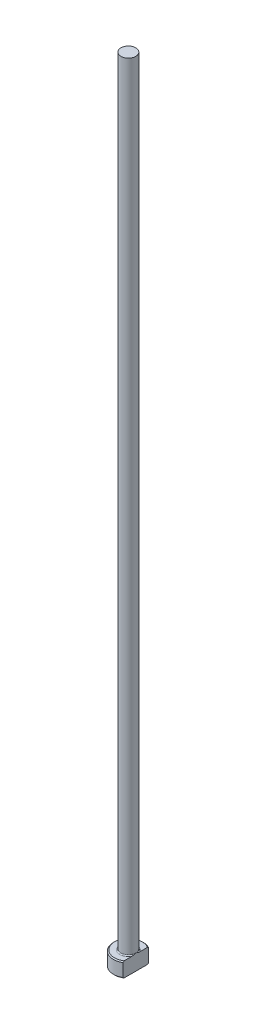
ISO-10303-21;
HEADER;
FILE_DESCRIPTION(('STEP AP214'),'2;1');
FILE_NAME('part.step','',(''),(''),'','','');
FILE_SCHEMA(('AUTOMOTIVE_DESIGN { 1 0 10303 214 1 1 1 1 }'));
ENDSEC;
DATA;
#1=APPLICATION_CONTEXT('core data for automotive mechanical design processes');
#2=APPLICATION_PROTOCOL_DEFINITION('international standard','automotive_design',2000,#1);
#3=PRODUCT_CONTEXT('',#1,'mechanical');
#4=PRODUCT('Part','Part','',(#3));
#5=PRODUCT_RELATED_PRODUCT_CATEGORY('part','',(#4));
#6=PRODUCT_DEFINITION_FORMATION('','',#4);
#7=PRODUCT_DEFINITION_CONTEXT('part definition',#1,'design');
#8=PRODUCT_DEFINITION('design','',#6,#7);
#9=PRODUCT_DEFINITION_SHAPE('','',#8);
#10=(LENGTH_UNIT() NAMED_UNIT(*) SI_UNIT(.MILLI.,.METRE.));
#11=(NAMED_UNIT(*) PLANE_ANGLE_UNIT() SI_UNIT($,.RADIAN.));
#12=(NAMED_UNIT(*) SI_UNIT($,.STERADIAN.) SOLID_ANGLE_UNIT());
#13=UNCERTAINTY_MEASURE_WITH_UNIT(LENGTH_MEASURE(1.E-05),#10,'distance_accuracy_value','');
#14=(GEOMETRIC_REPRESENTATION_CONTEXT(3) GLOBAL_UNCERTAINTY_ASSIGNED_CONTEXT((#13)) GLOBAL_UNIT_ASSIGNED_CONTEXT((#10,
#11,#12)) REPRESENTATION_CONTEXT('',''));
#15=CARTESIAN_POINT('',(0.,0.,0.));
#16=DIRECTION('',(0.,0.,1.));
#17=DIRECTION('',(1.,0.,0.));
#18=AXIS2_PLACEMENT_3D('',#15,#16,#17);
#19=CARTESIAN_POINT('',(0.,0.,0.));
#20=DIRECTION('',(0.,-1.,0.));
#21=DIRECTION('',(0.,0.,-1.));
#22=AXIS2_PLACEMENT_3D('',#19,#20,#21);
#23=PLANE('',#22);
#24=CARTESIAN_POINT('',(0.,0.,0.));
#25=DIRECTION('',(0.,-1.,0.));
#26=DIRECTION('',(0.,0.,-1.));
#27=AXIS2_PLACEMENT_3D('',#24,#25,#26);
#28=CIRCLE('',#27,2.79999999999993);
#29=CARTESIAN_POINT('',(1.49999999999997,0.,2.36431808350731));
#30=VERTEX_POINT('',#29);
#31=CARTESIAN_POINT('',(1.49999999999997,0.,-2.36431808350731));
#32=VERTEX_POINT('',#31);
#33=EDGE_CURVE('E98',#30,#32,#28,.T.);
#34=ORIENTED_EDGE('',*,*,#33,.T.);
#35=DIRECTION('',(0.,0.,1.));
#36=VECTOR('',#35,1.);
#37=CARTESIAN_POINT('',(1.49999999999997,0.,-2.5980762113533));
#38=LINE('',#37,#36);
#39=EDGE_CURVE('E83',#32,#30,#38,.T.);
#40=ORIENTED_EDGE('',*,*,#39,.T.);
#41=EDGE_LOOP('',(#34,#40));
#42=FACE_BOUND('',#41,.T.);
#43=ADVANCED_FACE('F32',(#42),#23,.T.);
#44=CARTESIAN_POINT('',(0.,259.958771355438,0.));
#45=DIRECTION('',(0.,1.,0.));
#46=DIRECTION('',(0.,0.,1.));
#47=AXIS2_PLACEMENT_3D('',#44,#45,#46);
#48=CYLINDRICAL_SURFACE('',#47,2.99999999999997);
#49=CARTESIAN_POINT('',(0.,2.80000000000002,0.));
#50=DIRECTION('',(0.,1.,0.));
#51=DIRECTION('',(0.,0.,1.));
#52=AXIS2_PLACEMENT_3D('',#49,#50,#51);
#53=CIRCLE('',#52,2.99999999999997);
#54=CARTESIAN_POINT('',(1.49999999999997,2.80000000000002,2.5980762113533));
#55=VERTEX_POINT('',#54);
#56=CARTESIAN_POINT('',(1.49999999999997,2.80000000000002,-2.5980762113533));
#57=VERTEX_POINT('',#56);
#58=EDGE_CURVE('E104',#55,#57,#53,.F.);
#59=ORIENTED_EDGE('',*,*,#58,.T.);
#60=DIRECTION('',(0.,-1.,0.));
#61=VECTOR('',#60,1.);
#62=CARTESIAN_POINT('',(1.49999999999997,160.,-2.5980762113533));
#63=LINE('',#62,#61);
#64=CARTESIAN_POINT('',(1.49999999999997,0.200000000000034,-2.5980762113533));
#65=VERTEX_POINT('',#64);
#66=EDGE_CURVE('E183',#57,#65,#63,.T.);
#67=ORIENTED_EDGE('',*,*,#66,.T.);
#68=CARTESIAN_POINT('',(0.,0.200000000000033,0.));
#69=DIRECTION('',(0.,-1.,0.));
#70=DIRECTION('',(0.,0.,-1.));
#71=AXIS2_PLACEMENT_3D('',#68,#69,#70);
#72=CIRCLE('',#71,2.99999999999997);
#73=CARTESIAN_POINT('',(1.49999999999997,0.200000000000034,2.5980762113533));
#74=VERTEX_POINT('',#73);
#75=EDGE_CURVE('E100',#65,#74,#72,.F.);
#76=ORIENTED_EDGE('',*,*,#75,.T.);
#77=DIRECTION('',(0.,-1.,0.));
#78=VECTOR('',#77,1.);
#79=CARTESIAN_POINT('',(1.49999999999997,160.,2.5980762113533));
#80=LINE('',#79,#78);
#81=EDGE_CURVE('E93',#55,#74,#80,.T.);
#82=ORIENTED_EDGE('',*,*,#81,.F.);
#83=EDGE_LOOP('',(#59,#67,#76,#82));
#84=FACE_BOUND('',#83,.T.);
#85=ADVANCED_FACE('F158',(#84),#48,.T.);
#86=CARTESIAN_POINT('',(-2.99999999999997,3.,0.));
#87=DIRECTION('',(0.,1.,0.));
#88=DIRECTION('',(0.,0.,1.));
#89=AXIS2_PLACEMENT_3D('',#86,#87,#88);
#90=PLANE('',#89);
#91=CARTESIAN_POINT('',(0.,3.,0.));
#92=DIRECTION('',(0.,1.,0.));
#93=DIRECTION('',(0.,0.,1.));
#94=AXIS2_PLACEMENT_3D('',#91,#92,#93);
#95=CIRCLE('',#94,2.79999999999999);
#96=CARTESIAN_POINT('',(1.49999999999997,3.,-2.36431808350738));
#97=VERTEX_POINT('',#96);
#98=CARTESIAN_POINT('',(1.49999999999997,3.,2.36431808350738));
#99=VERTEX_POINT('',#98);
#100=EDGE_CURVE('E178',#97,#99,#95,.T.);
#101=ORIENTED_EDGE('',*,*,#100,.T.);
#102=DIRECTION('',(0.,0.,-1.));
#103=VECTOR('',#102,1.);
#104=CARTESIAN_POINT('',(1.49999999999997,3.,0.));
#105=LINE('',#104,#103);
#106=CARTESIAN_POINT('',(1.49999999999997,2.99999999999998,0.799999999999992));
#107=VERTEX_POINT('',#106);
#108=EDGE_CURVE('E57',#99,#107,#105,.T.);
#109=ORIENTED_EDGE('',*,*,#108,.T.);
#110=CARTESIAN_POINT('',(0.,3.,0.));
#111=DIRECTION('',(0.,1.,0.));
#112=DIRECTION('',(0.,0.,1.));
#113=AXIS2_PLACEMENT_3D('',#110,#111,#112);
#114=CIRCLE('',#113,1.69999999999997);
#115=CARTESIAN_POINT('',(1.49999999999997,2.99999999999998,-0.799999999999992));
#116=VERTEX_POINT('',#115);
#117=EDGE_CURVE('E107',#107,#116,#114,.F.);
#118=ORIENTED_EDGE('',*,*,#117,.T.);
#119=EDGE_CURVE('E136',#116,#97,#105,.T.);
#120=ORIENTED_EDGE('',*,*,#119,.T.);
#121=EDGE_LOOP('',(#101,#109,#118,#120));
#122=FACE_BOUND('',#121,.T.);
#123=ADVANCED_FACE('F147',(#122),#90,.T.);
#124=CARTESIAN_POINT('',(0.,3.,0.));
#125=DIRECTION('',(0.,-1.,0.));
#126=DIRECTION('',(0.,0.,-1.));
#127=AXIS2_PLACEMENT_3D('',#124,#125,#126);
#128=CONICAL_SURFACE('',#127,2.79999999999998,0.785398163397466);
#129=ORIENTED_EDGE('',*,*,#58,.F.);
#130=CARTESIAN_POINT('',(1.49999999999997,-0.111741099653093,5.71827621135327));
#131=CARTESIAN_POINT('',(1.49999999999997,0.0136183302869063,5.58866816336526));
#132=CARTESIAN_POINT('',(1.49999999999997,0.138843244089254,5.45892957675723));
#133=CARTESIAN_POINT('',(1.49999999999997,0.388944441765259,5.19911365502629));
#134=CARTESIAN_POINT('',(1.49999999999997,0.513820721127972,5.06903631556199));
#135=CARTESIAN_POINT('',(1.49999999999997,0.763205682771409,4.80840180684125));
#136=CARTESIAN_POINT('',(1.49999999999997,0.887714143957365,4.67784442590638));
#137=CARTESIAN_POINT('',(1.49999999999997,1.13618059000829,4.41620813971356));
#138=CARTESIAN_POINT('',(1.49999999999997,1.26013857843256,4.28512923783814));
#139=CARTESIAN_POINT('',(1.49999999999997,1.50488975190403,4.02490837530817));
#140=CARTESIAN_POINT('',(1.49999999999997,1.6256969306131,3.89577958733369));
#141=CARTESIAN_POINT('',(1.49999999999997,1.86640694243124,3.63668213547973));
#142=CARTESIAN_POINT('',(1.49999999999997,1.98630978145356,3.50671347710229));
#143=CARTESIAN_POINT('',(1.49999999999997,2.22486033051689,3.24567921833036));
#144=CARTESIAN_POINT('',(1.49999999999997,2.34350830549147,3.11461386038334));
#145=CARTESIAN_POINT('',(1.49999999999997,2.57907716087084,2.85094268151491));
#146=CARTESIAN_POINT('',(1.49999999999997,2.69599811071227,2.71833692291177));
#147=CARTESIAN_POINT('',(1.49999999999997,2.88262371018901,2.50255231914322));
#148=CARTESIAN_POINT('',(1.49999999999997,2.95312454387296,2.42006293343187));
#149=CARTESIAN_POINT('',(1.49999999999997,3.0928709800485,2.25401084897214));
#150=CARTESIAN_POINT('',(1.49999999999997,3.16211645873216,2.17044804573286));
#151=CARTESIAN_POINT('',(1.49999999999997,3.29964684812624,2.00105967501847));
#152=CARTESIAN_POINT('',(1.49999999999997,3.36791386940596,1.91521952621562));
#153=CARTESIAN_POINT('',(1.49999999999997,3.50205840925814,1.74171392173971));
#154=CARTESIAN_POINT('',(1.49999999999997,3.56793649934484,1.65404891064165));
#155=CARTESIAN_POINT('',(1.49999999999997,3.69728151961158,1.47490236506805));
#156=CARTESIAN_POINT('',(1.49999999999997,3.76069661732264,1.38338308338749));
#157=CARTESIAN_POINT('',(1.49999999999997,3.8823953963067,1.19675661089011));
#158=CARTESIAN_POINT('',(1.49999999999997,3.94067201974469,1.10164473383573));
#159=CARTESIAN_POINT('',(1.49999999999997,4.04841325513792,0.908008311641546));
#160=CARTESIAN_POINT('',(1.49999999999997,4.0979780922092,0.809540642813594));
#161=CARTESIAN_POINT('',(1.49999999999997,4.18432188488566,0.607192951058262));
#162=CARTESIAN_POINT('',(1.49999999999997,4.22114374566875,0.503332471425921));
#163=CARTESIAN_POINT('',(1.49999999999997,4.26099935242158,0.347577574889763));
#164=CARTESIAN_POINT('',(1.49999999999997,4.27157029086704,0.297609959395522));
#165=CARTESIAN_POINT('',(1.49999999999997,4.28794860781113,0.196885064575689));
#166=CARTESIAN_POINT('',(1.49999999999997,4.29375640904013,0.146127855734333));
#167=CARTESIAN_POINT('',(1.49999999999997,4.30019707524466,0.0444388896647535));
#168=CARTESIAN_POINT('',(1.49999999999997,4.30084594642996,-0.00649183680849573));
#169=CARTESIAN_POINT('',(1.49999999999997,4.29696416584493,-0.108155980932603));
#170=CARTESIAN_POINT('',(1.49999999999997,4.29243308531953,-0.15888938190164));
#171=CARTESIAN_POINT('',(1.49999999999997,4.27856915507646,-0.259234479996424));
#172=CARTESIAN_POINT('',(1.49999999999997,4.26927821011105,-0.30885208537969));
#173=CARTESIAN_POINT('',(1.49999999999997,4.24647108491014,-0.407110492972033));
#174=CARTESIAN_POINT('',(1.49999999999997,4.2329532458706,-0.455750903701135));
#175=CARTESIAN_POINT('',(1.49999999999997,4.20226175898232,-0.552149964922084));
#176=CARTESIAN_POINT('',(1.49999999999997,4.18506801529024,-0.599902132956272));
#177=CARTESIAN_POINT('',(1.49999999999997,4.14771387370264,-0.694205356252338));
#178=CARTESIAN_POINT('',(1.49999999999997,4.1275540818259,-0.740756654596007));
#179=CARTESIAN_POINT('',(1.49999999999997,4.06327696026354,-0.879166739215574));
#180=CARTESIAN_POINT('',(1.49999999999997,4.01551721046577,-0.969329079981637));
#181=CARTESIAN_POINT('',(1.49999999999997,3.91367909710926,-1.1460431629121));
#182=CARTESIAN_POINT('',(1.49999999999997,3.85959300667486,-1.23259031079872));
#183=CARTESIAN_POINT('',(1.49999999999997,3.74697968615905,-1.40321348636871));
#184=CARTESIAN_POINT('',(1.49999999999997,3.68843573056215,-1.48727838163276));
#185=CARTESIAN_POINT('',(1.49999999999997,3.56843845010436,-1.65322187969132));
#186=CARTESIAN_POINT('',(1.49999999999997,3.50698656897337,-1.73510153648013));
#187=CARTESIAN_POINT('',(1.49999999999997,3.38115673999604,-1.89829823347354));
#188=CARTESIAN_POINT('',(1.49999999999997,3.31675092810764,-1.97959369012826));
#189=CARTESIAN_POINT('',(1.49999999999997,3.18634068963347,-2.14090082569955));
#190=CARTESIAN_POINT('',(1.49999999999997,3.12033609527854,-2.22091236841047));
#191=CARTESIAN_POINT('',(1.49999999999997,2.92086431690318,-2.45906508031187));
#192=CARTESIAN_POINT('',(1.49999999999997,2.78562663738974,-2.61572090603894));
#193=CARTESIAN_POINT('',(1.49999999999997,2.53554498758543,-2.90006295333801));
#194=CARTESIAN_POINT('',(1.49999999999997,2.42114543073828,-3.02814382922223));
#195=CARTESIAN_POINT('',(1.49999999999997,2.19093557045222,-3.28303767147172));
#196=CARTESIAN_POINT('',(1.49999999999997,2.07512522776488,-3.40985060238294));
#197=CARTESIAN_POINT('',(1.49999999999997,1.72597067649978,-3.7891384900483));
#198=CARTESIAN_POINT('',(1.49999999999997,1.49111760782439,-4.04022177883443));
#199=CARTESIAN_POINT('',(1.49999999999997,1.02882478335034,-4.52992803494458));
#200=CARTESIAN_POINT('',(1.49999999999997,0.801477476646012,-4.76863870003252));
#201=CARTESIAN_POINT('',(1.49999999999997,0.459548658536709,-5.12558036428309));
#202=CARTESIAN_POINT('',(1.49999999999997,0.345484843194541,-5.2443077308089));
#203=CARTESIAN_POINT('',(1.49999999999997,0.117071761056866,-5.48148573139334));
#204=CARTESIAN_POINT('',(1.49999999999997,0.00272249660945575,-5.59993636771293));
#205=CARTESIAN_POINT('',(1.49999999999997,-0.111741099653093,-5.71827621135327));
#206=B_SPLINE_CURVE_WITH_KNOTS('',3,(#130,#131,#132,#133,#134,#135,#136,#137,#138,#139,#140,
#141,#142,#143,#144,#145,#146,#147,#148,#149,#150,#151,#152,#153,#154,#155,#156,#157,#158,#159,
#160,#161,#162,#163,#164,#165,#166,#167,#168,#169,#170,#171,#172,#173,#174,#175,#176,#177,#178,
#179,#180,#181,#182,#183,#184,#185,#186,#187,#188,#189,#190,#191,#192,#193,#194,#195,#196,#197,
#198,#199,#200,#201,#202,#203,#204,#205),.UNSPECIFIED.,.F.,.F.,(4,2,2,2,2,2,2,2,2,2,2,2,2,2,2,2,
2,2,2,2,2,2,2,2,2,2,2,2,2,2,2,2,2,2,2,2,2,4),(0.,0.540943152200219,1.08189327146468,
1.62312052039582,2.16434426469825,2.69482920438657,3.22531067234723,3.75567781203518,
4.2860235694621,4.61155053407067,4.93710943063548,5.2661094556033,5.59503024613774,
5.92894782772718,6.26331713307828,6.59354403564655,6.92264800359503,7.0756747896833,
7.22868799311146,7.38122626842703,7.53377717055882,7.68500755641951,7.83629736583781,
7.98843643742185,8.14054446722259,8.44618799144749,8.75220879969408,9.05944044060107,
9.36652111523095,9.67764287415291,9.98879742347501,10.6095925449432,11.1247803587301,
11.6399825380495,12.6713544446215,13.6603005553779,14.1542238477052,14.6481430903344),.UNSPECIFIED.);
#207=EDGE_CURVE('E135',#55,#99,#206,.T.);
#208=ORIENTED_EDGE('',*,*,#207,.T.);
#209=ORIENTED_EDGE('',*,*,#100,.F.);
#210=EDGE_CURVE('E127',#97,#57,#206,.T.);
#211=ORIENTED_EDGE('',*,*,#210,.T.);
#212=EDGE_LOOP('',(#129,#208,#209,#211));
#213=FACE_BOUND('',#212,.T.);
#214=ADVANCED_FACE('F143',(#213),#128,.T.);
#215=CARTESIAN_POINT('',(0.,0.200000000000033,0.));
#216=DIRECTION('',(0.,1.,0.));
#217=DIRECTION('',(0.,0.,1.));
#218=AXIS2_PLACEMENT_3D('',#215,#216,#217);
#219=CONICAL_SURFACE('',#218,2.99999999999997,0.785398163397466);
#220=ORIENTED_EDGE('',*,*,#75,.F.);
#221=CARTESIAN_POINT('',(1.49999999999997,3.11174109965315,-5.71827621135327));
#222=CARTESIAN_POINT('',(1.49999999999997,2.98638166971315,-5.58866816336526));
#223=CARTESIAN_POINT('',(1.49999999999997,2.8611567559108,-5.45892957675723));
#224=CARTESIAN_POINT('',(1.49999999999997,2.6110555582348,-5.19911365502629));
#225=CARTESIAN_POINT('',(1.49999999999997,2.48617927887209,-5.06903631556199));
#226=CARTESIAN_POINT('',(1.49999999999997,2.23679431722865,-4.80840180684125));
#227=CARTESIAN_POINT('',(1.49999999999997,2.11228585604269,-4.67784442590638));
#228=CARTESIAN_POINT('',(1.49999999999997,1.86381940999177,-4.41620813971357));
#229=CARTESIAN_POINT('',(1.49999999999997,1.7398614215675,-4.28512923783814));
#230=CARTESIAN_POINT('',(1.49999999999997,1.49511024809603,-4.02490837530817));
#231=CARTESIAN_POINT('',(1.49999999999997,1.37430306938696,-3.89577958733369));
#232=CARTESIAN_POINT('',(1.49999999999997,1.13359305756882,-3.63668213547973));
#233=CARTESIAN_POINT('',(1.49999999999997,1.0136902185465,-3.50671347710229));
#234=CARTESIAN_POINT('',(1.49999999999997,0.775139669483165,-3.24567921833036));
#235=CARTESIAN_POINT('',(1.49999999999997,0.656491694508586,-3.11461386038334));
#236=CARTESIAN_POINT('',(1.49999999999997,0.420922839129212,-2.85094268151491));
#237=CARTESIAN_POINT('',(1.49999999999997,0.304001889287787,-2.71833692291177));
#238=CARTESIAN_POINT('',(1.49999999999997,0.117376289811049,-2.50255231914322));
#239=CARTESIAN_POINT('',(1.49999999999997,0.0468754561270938,-2.42006293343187));
#240=CARTESIAN_POINT('',(1.49999999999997,-0.0928709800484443,-2.25401084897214));
#241=CARTESIAN_POINT('',(1.49999999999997,-0.162116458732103,-2.17044804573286));
#242=CARTESIAN_POINT('',(1.49999999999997,-0.299646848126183,-2.00105967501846));
#243=CARTESIAN_POINT('',(1.49999999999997,-0.367913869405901,-1.91521952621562));
#244=CARTESIAN_POINT('',(1.49999999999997,-0.502058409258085,-1.74171392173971));
#245=CARTESIAN_POINT('',(1.49999999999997,-0.567936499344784,-1.65404891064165));
#246=CARTESIAN_POINT('',(1.49999999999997,-0.697281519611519,-1.47490236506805));
#247=CARTESIAN_POINT('',(1.49999999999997,-0.760696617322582,-1.38338308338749));
#248=CARTESIAN_POINT('',(1.49999999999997,-0.882395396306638,-1.19675661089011));
#249=CARTESIAN_POINT('',(1.49999999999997,-0.940672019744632,-1.10164473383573));
#250=CARTESIAN_POINT('',(1.49999999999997,-1.04841325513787,-0.908008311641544));
#251=CARTESIAN_POINT('',(1.49999999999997,-1.09797809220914,-0.809540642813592));
#252=CARTESIAN_POINT('',(1.49999999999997,-1.1843218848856,-0.60719295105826));
#253=CARTESIAN_POINT('',(1.49999999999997,-1.22114374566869,-0.503332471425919));
#254=CARTESIAN_POINT('',(1.49999999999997,-1.26099935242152,-0.347577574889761));
#255=CARTESIAN_POINT('',(1.49999999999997,-1.27157029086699,-0.29760995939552));
#256=CARTESIAN_POINT('',(1.49999999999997,-1.28794860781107,-0.196885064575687));
#257=CARTESIAN_POINT('',(1.49999999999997,-1.29375640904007,-0.146127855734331));
#258=CARTESIAN_POINT('',(1.49999999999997,-1.30019707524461,-0.0444388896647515));
#259=CARTESIAN_POINT('',(1.49999999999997,-1.3008459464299,0.00649183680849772));
#260=CARTESIAN_POINT('',(1.49999999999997,-1.29696416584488,0.108155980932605));
#261=CARTESIAN_POINT('',(1.49999999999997,-1.29243308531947,0.158889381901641));
#262=CARTESIAN_POINT('',(1.49999999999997,-1.2785691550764,0.259234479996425));
#263=CARTESIAN_POINT('',(1.49999999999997,-1.26927821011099,0.308852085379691));
#264=CARTESIAN_POINT('',(1.49999999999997,-1.24647108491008,0.407110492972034));
#265=CARTESIAN_POINT('',(1.49999999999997,-1.23295324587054,0.455750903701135));
#266=CARTESIAN_POINT('',(1.49999999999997,-1.20226175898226,0.552149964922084));
#267=CARTESIAN_POINT('',(1.49999999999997,-1.18506801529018,0.599902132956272));
#268=CARTESIAN_POINT('',(1.49999999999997,-1.14771387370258,0.694205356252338));
#269=CARTESIAN_POINT('',(1.49999999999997,-1.12755408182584,0.740756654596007));
#270=CARTESIAN_POINT('',(1.49999999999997,-1.06327696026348,0.879166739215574));
#271=CARTESIAN_POINT('',(1.49999999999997,-1.01551721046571,0.969329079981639));
#272=CARTESIAN_POINT('',(1.49999999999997,-0.913679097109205,1.1460431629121));
#273=CARTESIAN_POINT('',(1.49999999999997,-0.8595930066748,1.23259031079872));
#274=CARTESIAN_POINT('',(1.49999999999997,-0.746979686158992,1.40321348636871));
#275=CARTESIAN_POINT('',(1.49999999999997,-0.688435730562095,1.48727838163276));
#276=CARTESIAN_POINT('',(1.49999999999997,-0.568438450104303,1.65322187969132));
#277=CARTESIAN_POINT('',(1.49999999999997,-0.506986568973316,1.73510153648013));
#278=CARTESIAN_POINT('',(1.49999999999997,-0.381156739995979,1.89829823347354));
#279=CARTESIAN_POINT('',(1.49999999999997,-0.316750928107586,1.97959369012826));
#280=CARTESIAN_POINT('',(1.49999999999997,-0.186340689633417,2.14090082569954));
#281=CARTESIAN_POINT('',(1.49999999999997,-0.120336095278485,2.22091236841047));
#282=CARTESIAN_POINT('',(1.49999999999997,0.0791356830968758,2.45906508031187));
#283=CARTESIAN_POINT('',(1.49999999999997,0.214373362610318,2.61572090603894));
#284=CARTESIAN_POINT('',(1.49999999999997,0.46445501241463,2.90006295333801));
#285=CARTESIAN_POINT('',(1.49999999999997,0.578854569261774,3.02814382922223));
#286=CARTESIAN_POINT('',(1.49999999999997,0.809064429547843,3.28303767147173));
#287=CARTESIAN_POINT('',(1.49999999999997,0.924874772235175,3.40985060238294));
#288=CARTESIAN_POINT('',(1.49999999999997,1.27402932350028,3.78913849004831));
#289=CARTESIAN_POINT('',(1.49999999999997,1.50888239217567,4.04022177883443));
#290=CARTESIAN_POINT('',(1.49999999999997,1.97117521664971,4.52992803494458));
#291=CARTESIAN_POINT('',(1.49999999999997,2.19852252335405,4.76863870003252));
#292=CARTESIAN_POINT('',(1.49999999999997,2.54045134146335,5.12558036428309));
#293=CARTESIAN_POINT('',(1.49999999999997,2.65451515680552,5.2443077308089));
#294=CARTESIAN_POINT('',(1.49999999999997,2.88292823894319,5.48148573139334));
#295=CARTESIAN_POINT('',(1.49999999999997,2.9972775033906,5.59993636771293));
#296=CARTESIAN_POINT('',(1.49999999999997,3.11174109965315,5.71827621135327));
#297=B_SPLINE_CURVE_WITH_KNOTS('',3,(#221,#222,#223,#224,#225,#226,#227,#228,#229,#230,#231,
#232,#233,#234,#235,#236,#237,#238,#239,#240,#241,#242,#243,#244,#245,#246,#247,#248,#249,#250,
#251,#252,#253,#254,#255,#256,#257,#258,#259,#260,#261,#262,#263,#264,#265,#266,#267,#268,#269,
#270,#271,#272,#273,#274,#275,#276,#277,#278,#279,#280,#281,#282,#283,#284,#285,#286,#287,#288,
#289,#290,#291,#292,#293,#294,#295,#296),.UNSPECIFIED.,.F.,.F.,(4,2,2,2,2,2,2,2,2,2,2,2,2,2,2,2,
2,2,2,2,2,2,2,2,2,2,2,2,2,2,2,2,2,2,2,2,2,4),(0.,0.540943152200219,1.08189327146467,
1.62312052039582,2.16434426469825,2.69482920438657,3.22531067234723,3.75567781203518,
4.28602356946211,4.61155053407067,4.93710943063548,5.2661094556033,5.59503024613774,
5.92894782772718,6.26331713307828,6.59354403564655,6.92264800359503,7.0756747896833,
7.22868799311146,7.38122626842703,7.53377717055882,7.68500755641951,7.83629736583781,
7.98843643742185,8.14054446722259,8.4461879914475,8.75220879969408,9.05944044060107,
9.36652111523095,9.6776428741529,9.98879742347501,10.6095925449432,11.1247803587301,
11.6399825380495,12.6713544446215,13.6603005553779,14.1542238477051,14.6481430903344),.UNSPECIFIED.);
#298=EDGE_CURVE('E86',#65,#32,#297,.T.);
#299=ORIENTED_EDGE('',*,*,#298,.T.);
#300=ORIENTED_EDGE('',*,*,#33,.F.);
#301=EDGE_CURVE('E89',#30,#74,#297,.T.);
#302=ORIENTED_EDGE('',*,*,#301,.T.);
#303=EDGE_LOOP('',(#220,#299,#300,#302));
#304=FACE_BOUND('',#303,.T.);
#305=ADVANCED_FACE('F97',(#304),#219,.T.);
#306=CARTESIAN_POINT('',(0.,3.19999999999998,0.));
#307=DIRECTION('',(0.,1.,0.));
#308=DIRECTION('',(0.,0.,1.));
#309=AXIS2_PLACEMENT_3D('',#306,#307,#308);
#310=TOROIDAL_SURFACE('',#309,1.69999999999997,0.2);
#311=CARTESIAN_POINT('',(1.49999999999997,3.19999999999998,0.));
#312=CARTESIAN_POINT('',(1.49999999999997,3.20000050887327,7.14686524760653E-11));
#313=CARTESIAN_POINT('',(1.49999999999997,3.20000101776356,-1.21663671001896E-07));
#314=CARTESIAN_POINT('',(1.49999999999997,3.20000199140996,-4.97616231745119E-07));
#315=CARTESIAN_POINT('',(1.49999999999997,3.20000245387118,-7.56516213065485E-07));
#316=CARTESIAN_POINT('',(1.49999999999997,3.20000338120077,-1.37642836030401E-06));
#317=CARTESIAN_POINT('',(1.49999999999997,3.20000384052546,-1.74563475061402E-06));
#318=CARTESIAN_POINT('',(1.49999999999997,3.20000469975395,-2.53565983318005E-06));
#319=CARTESIAN_POINT('',(1.49999999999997,3.20000510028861,-2.95582595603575E-06));
#320=CARTESIAN_POINT('',(1.49999999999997,3.20000646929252,-4.48430443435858E-06));
#321=CARTESIAN_POINT('',(1.49999999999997,3.20000736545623,-5.6586103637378E-06));
#322=CARTESIAN_POINT('',(1.49999999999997,3.20000893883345,-8.06479198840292E-06));
#323=CARTESIAN_POINT('',(1.49999999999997,3.20000962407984,-9.29170513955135E-06));
#324=CARTESIAN_POINT('',(1.49999999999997,3.2000122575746,-1.41623288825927E-05));
#325=CARTESIAN_POINT('',(1.49999999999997,3.20001407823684,-1.78790031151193E-05));
#326=CARTESIAN_POINT('',(1.49999999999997,3.20001699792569,-2.51443065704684E-05));
#327=CARTESIAN_POINT('',(1.49999999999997,3.20001815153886,-2.86715393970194E-05));
#328=CARTESIAN_POINT('',(1.49999999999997,3.20002315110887,-4.39218127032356E-05));
#329=CARTESIAN_POINT('',(1.49999999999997,3.2000270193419,-5.56288388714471E-05));
#330=CARTESIAN_POINT('',(1.49999999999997,3.20003312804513,-7.74058287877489E-05));
#331=CARTESIAN_POINT('',(1.49999999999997,3.20003553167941,-8.7427840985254E-05));
#332=CARTESIAN_POINT('',(1.49999999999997,3.20005483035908,-0.00016122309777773));
#333=CARTESIAN_POINT('',(1.49999999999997,3.2000797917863,-0.000222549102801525));
#334=CARTESIAN_POINT('',(1.49999999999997,3.20017391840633,-0.000462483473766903));
#335=CARTESIAN_POINT('',(1.49999999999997,3.20023706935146,-0.000642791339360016));
#336=CARTESIAN_POINT('',(1.49999999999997,3.20048761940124,-0.00134785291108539));
#337=CARTESIAN_POINT('',(1.49999999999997,3.20068132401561,-0.00187087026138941));
#338=CARTESIAN_POINT('',(1.49999999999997,3.20147357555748,-0.0040200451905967));
#339=CARTESIAN_POINT('',(1.49999999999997,3.20206499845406,-0.00564811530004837));
#340=CARTESIAN_POINT('',(1.49999999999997,3.2089263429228,-0.0245232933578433));
#341=CARTESIAN_POINT('',(1.49999999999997,3.21523683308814,-0.0417598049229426));
#342=CARTESIAN_POINT('',(1.49999999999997,3.22755028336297,-0.0756091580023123));
#343=CARTESIAN_POINT('',(1.49999999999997,3.23355589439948,-0.0922211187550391));
#344=CARTESIAN_POINT('',(1.49999999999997,3.2462010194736,-0.127454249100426));
#345=CARTESIAN_POINT('',(1.49999999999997,3.25283080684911,-0.146078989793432));
#346=CARTESIAN_POINT('',(1.49999999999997,3.26599765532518,-0.183577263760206));
#347=CARTESIAN_POINT('',(1.49999999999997,3.2725330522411,-0.202451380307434));
#348=CARTESIAN_POINT('',(1.49999999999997,3.28834228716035,-0.248982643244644));
#349=CARTESIAN_POINT('',(1.49999999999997,3.29749152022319,-0.276682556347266));
#350=CARTESIAN_POINT('',(1.49999999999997,3.3149093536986,-0.331625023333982));
#351=CARTESIAN_POINT('',(1.49999999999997,3.32319386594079,-0.358862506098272));
#352=CARTESIAN_POINT('',(1.49999999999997,3.34051594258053,-0.419125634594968));
#353=CARTESIAN_POINT('',(1.49999999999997,3.34936607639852,-0.452206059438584));
#354=CARTESIAN_POINT('',(1.49999999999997,3.36549583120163,-0.519023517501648));
#355=CARTESIAN_POINT('',(1.49999999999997,3.37276283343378,-0.552763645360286));
#356=CARTESIAN_POINT('',(1.49999999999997,3.38554755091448,-0.623053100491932));
#357=CARTESIAN_POINT('',(1.49999999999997,3.39090573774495,-0.659632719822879));
#358=CARTESIAN_POINT('',(1.49999999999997,3.39825016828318,-0.733028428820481));
#359=CARTESIAN_POINT('',(1.49999999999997,3.40024734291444,-0.769843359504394));
#360=CARTESIAN_POINT('',(1.49999999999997,3.39970780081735,-0.842856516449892));
#361=CARTESIAN_POINT('',(1.49999999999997,3.39725347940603,-0.87905368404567));
#362=CARTESIAN_POINT('',(1.49999999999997,3.38900085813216,-0.932380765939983));
#363=CARTESIAN_POINT('',(1.49999999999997,3.38553049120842,-0.949868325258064));
#364=CARTESIAN_POINT('',(1.49999999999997,3.37678336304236,-0.98437493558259));
#365=CARTESIAN_POINT('',(1.49999999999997,3.37150943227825,-1.00139467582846));
#366=CARTESIAN_POINT('',(1.49999999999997,3.35869781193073,-1.03479423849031));
#367=CARTESIAN_POINT('',(1.49999999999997,3.3511359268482,-1.05116499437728));
#368=CARTESIAN_POINT('',(1.49999999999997,3.33325333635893,-1.08234828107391));
#369=CARTESIAN_POINT('',(1.49999999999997,3.32294266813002,-1.097166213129));
#370=CARTESIAN_POINT('',(1.49999999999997,3.30512758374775,-1.11714173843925));
#371=CARTESIAN_POINT('',(1.49999999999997,3.29884721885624,-1.1233906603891));
#372=CARTESIAN_POINT('',(1.49999999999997,3.28545950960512,-1.13494695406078));
#373=CARTESIAN_POINT('',(1.49999999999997,3.27835226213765,-1.14025443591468));
#374=CARTESIAN_POINT('',(1.49999999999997,3.26325970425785,-1.14967631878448));
#375=CARTESIAN_POINT('',(1.49999999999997,3.25526534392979,-1.1537764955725));
#376=CARTESIAN_POINT('',(1.49999999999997,3.23863207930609,-1.16034952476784));
#377=CARTESIAN_POINT('',(1.49999999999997,3.22999427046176,-1.16282507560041));
#378=CARTESIAN_POINT('',(1.49999999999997,3.21343922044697,-1.16570267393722));
#379=CARTESIAN_POINT('',(1.49999999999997,3.20555896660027,-1.16631687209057));
#380=CARTESIAN_POINT('',(1.49999999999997,3.18982775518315,-1.16602054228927));
#381=CARTESIAN_POINT('',(1.49999999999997,3.18197679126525,-1.16511036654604));
#382=CARTESIAN_POINT('',(1.49999999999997,3.16747846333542,-1.16204446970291));
#383=CARTESIAN_POINT('',(1.49999999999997,3.16079696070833,-1.16004509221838));
#384=CARTESIAN_POINT('',(1.49999999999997,3.14781700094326,-1.15505972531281));
#385=CARTESIAN_POINT('',(1.49999999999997,3.14151862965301,-1.1520735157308));
#386=CARTESIAN_POINT('',(1.49999999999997,3.12690214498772,-1.14387585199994));
#387=CARTESIAN_POINT('',(1.49999999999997,3.11881436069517,-1.13825400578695));
#388=CARTESIAN_POINT('',(1.49999999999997,3.1036444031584,-1.12578441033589));
#389=CARTESIAN_POINT('',(1.49999999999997,3.09656475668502,-1.11893367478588));
#390=CARTESIAN_POINT('',(1.49999999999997,3.08012297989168,-1.10074342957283));
#391=CARTESIAN_POINT('',(1.49999999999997,3.07136543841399,-1.08886044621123));
#392=CARTESIAN_POINT('',(1.49999999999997,3.05578194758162,-1.06392743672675));
#393=CARTESIAN_POINT('',(1.49999999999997,3.0489571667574,-1.05087671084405));
#394=CARTESIAN_POINT('',(1.49999999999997,3.03273856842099,-1.0147230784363));
#395=CARTESIAN_POINT('',(1.49999999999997,3.02486230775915,-0.990945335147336));
#396=CARTESIAN_POINT('',(1.49999999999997,3.01257693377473,-0.942321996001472));
#397=CARTESIAN_POINT('',(1.49999999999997,3.00820590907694,-0.917467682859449));
#398=CARTESIAN_POINT('',(1.49999999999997,3.00229956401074,-0.867912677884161));
#399=CARTESIAN_POINT('',(1.49999999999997,3.0007128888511,-0.843217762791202));
#400=CARTESIAN_POINT('',(1.49999999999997,2.9996723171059,-0.793746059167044));
#401=CARTESIAN_POINT('',(1.49999999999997,3.0002230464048,-0.768969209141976));
#402=CARTESIAN_POINT('',(1.49999999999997,3.00433101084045,-0.696994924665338));
#403=CARTESIAN_POINT('',(1.49999999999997,3.01016976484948,-0.649931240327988));
#404=CARTESIAN_POINT('',(1.49999999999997,3.02567776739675,-0.559166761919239));
#405=CARTESIAN_POINT('',(1.49999999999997,3.03511950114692,-0.515423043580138));
#406=CARTESIAN_POINT('',(1.49999999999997,3.05693059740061,-0.427590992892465));
#407=CARTESIAN_POINT('',(1.49999999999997,3.0693635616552,-0.383518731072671));
#408=CARTESIAN_POINT('',(1.49999999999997,3.0917495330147,-0.310161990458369));
#409=CARTESIAN_POINT('',(1.49999999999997,3.1011984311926,-0.280718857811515));
#410=CARTESIAN_POINT('',(1.49999999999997,3.12060442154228,-0.22234098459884));
#411=CARTESIAN_POINT('',(1.49999999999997,3.13055519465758,-0.193404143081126));
#412=CARTESIAN_POINT('',(1.49999999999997,3.14973721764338,-0.1387568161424));
#413=CARTESIAN_POINT('',(1.49999999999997,3.15893123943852,-0.113033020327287));
#414=CARTESIAN_POINT('',(1.49999999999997,3.17788037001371,-0.0606351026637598));
#415=CARTESIAN_POINT('',(1.49999999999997,3.18764328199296,-0.0339636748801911));
#416=CARTESIAN_POINT('',(1.49999999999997,3.19793548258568,-0.00564657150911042));
#417=CARTESIAN_POINT('',(1.49999999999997,3.19852751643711,-0.00401699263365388));
#418=CARTESIAN_POINT('',(1.49999999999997,3.1993199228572,-0.00186745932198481));
#419=CARTESIAN_POINT('',(1.49999999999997,3.1995131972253,-0.00134559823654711));
#420=CARTESIAN_POINT('',(1.49999999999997,3.19976322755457,-0.000641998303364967));
#421=CARTESIAN_POINT('',(1.49999999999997,3.19982627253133,-0.000461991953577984));
#422=CARTESIAN_POINT('',(1.49999999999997,3.19992025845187,-0.000222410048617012));
#423=CARTESIAN_POINT('',(1.49999999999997,3.19994519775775,-0.000161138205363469));
#424=CARTESIAN_POINT('',(1.49999999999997,3.1999644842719,-8.74039265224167E-05));
#425=CARTESIAN_POINT('',(1.49999999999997,3.19996688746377,-7.73857554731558E-05));
#426=CARTESIAN_POINT('',(1.49999999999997,3.19997299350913,-5.56173270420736E-05));
#427=CARTESIAN_POINT('',(1.49999999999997,3.19997685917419,-4.39149185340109E-05));
#428=CARTESIAN_POINT('',(1.49999999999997,3.19998185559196,-2.86698156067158E-05));
#429=CARTESIAN_POINT('',(1.49999999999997,3.19998300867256,-2.51431574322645E-05));
#430=CARTESIAN_POINT('',(1.49999999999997,3.19998592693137,-1.78789551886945E-05));
#431=CARTESIAN_POINT('',(1.49999999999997,3.19998774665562,-1.41627846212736E-05));
#432=CARTESIAN_POINT('',(1.49999999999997,3.1999903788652,-9.29264485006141E-06));
#433=CARTESIAN_POINT('',(1.49999999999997,3.19999106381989,-8.06577596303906E-06));
#434=CARTESIAN_POINT('',(1.49999999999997,3.19999263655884,-5.65962636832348E-06));
#435=CARTESIAN_POINT('',(1.49999999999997,3.19999353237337,-4.48530463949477E-06));
#436=CARTESIAN_POINT('',(1.49999999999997,3.19999490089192,-2.95673739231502E-06));
#437=CARTESIAN_POINT('',(1.49999999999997,3.19999530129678,-2.53653206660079E-06));
#438=CARTESIAN_POINT('',(1.49999999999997,3.19999616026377,-1.74640524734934E-06));
#439=CARTESIAN_POINT('',(1.49999999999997,3.19999661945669,-1.37713597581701E-06));
#440=CARTESIAN_POINT('',(1.49999999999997,3.19999754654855,-7.57072329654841E-07));
#441=CARTESIAN_POINT('',(1.49999999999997,3.1999980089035,-4.98087382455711E-07));
#442=CARTESIAN_POINT('',(1.49999999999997,3.19999898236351,-1.21927247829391E-07));
#443=CARTESIAN_POINT('',(1.49999999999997,3.19999949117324,-7.14621145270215E-11));
#444=CARTESIAN_POINT('',(1.49999999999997,3.19999999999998,0.));
#445=B_SPLINE_CURVE_WITH_KNOTS('',3,(#311,#312,#313,#314,#315,#316,#317,#318,#319,#320,#321,
#322,#323,#324,#325,#326,#327,#328,#329,#330,#331,#332,#333,#334,#335,#336,#337,#338,#339,#340,
#341,#342,#343,#344,#345,#346,#347,#348,#349,#350,#351,#352,#353,#354,#355,#356,#357,#358,#359,
#360,#361,#362,#363,#364,#365,#366,#367,#368,#369,#370,#371,#372,#373,#374,#375,#376,#377,#378,
#379,#380,#381,#382,#383,#384,#385,#386,#387,#388,#389,#390,#391,#392,#393,#394,#395,#396,#397,
#398,#399,#400,#401,#402,#403,#404,#405,#406,#407,#408,#409,#410,#411,#412,#413,#414,#415,#416,
#417,#418,#419,#420,#421,#422,#423,#424,#425,#426,#427,#428,#429,#430,#431,#432,#433,#434,#435,
#436,#437,#438,#439,#440,#441,#442,#443,#444),.UNSPECIFIED.,.T.,.F.,(4,2,2,2,2,2,2,2,2,2,2,2,2,
2,2,2,2,2,2,2,2,2,2,2,2,2,2,2,2,2,2,2,2,2,2,2,2,2,2,2,2,2,2,2,2,2,2,2,2,2,2,2,2,2,2,2,2,2,2,2,2,
2,2,2,2,2,4),(0.,1.5268750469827E-06,3.1095939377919E-06,4.8697676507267E-06,
6.6094009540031E-06,1.1020252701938E-05,1.52327800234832E-05,2.76140373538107E-05,
3.87351647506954E-05,7.57188333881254E-05,0.000106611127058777,0.000304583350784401,
0.000878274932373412,0.00255078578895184,0.00774802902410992,0.0628090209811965,
0.115802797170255,0.175110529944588,0.235030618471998,0.322539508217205,0.407938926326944,
0.510638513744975,0.614128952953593,0.724918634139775,0.835347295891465,0.943752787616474,
0.997165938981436,1.05049564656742,1.10441029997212,1.1581307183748,1.18463966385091,
1.21114550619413,1.23795217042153,1.26471419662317,1.28828324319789,1.31184684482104,
1.33268332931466,1.35352446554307,1.38290826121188,1.41236445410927,1.45639976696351,
1.5004616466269,1.5751878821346,1.65071550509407,1.72483484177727,1.79911468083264,
1.94105061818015,2.07520625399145,2.21251544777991,2.30527614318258,2.3970705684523,
2.47902409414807,2.56422207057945,2.56942417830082,2.57109299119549,2.57166572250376,
2.57186352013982,2.57189440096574,2.57193136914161,2.5719424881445,2.5719548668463,
2.57195907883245,2.5719634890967,2.571965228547,2.57196698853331,2.5719685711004,
2.57197009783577),.UNSPECIFIED.);
#446=CARTESIAN_POINT('',(1.49999999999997,3.19999999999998,0.));
#447=VERTEX_POINT('',#446);
#448=EDGE_CURVE('E11',#116,#447,#445,.T.);
#449=ORIENTED_EDGE('',*,*,#448,.F.);
#450=ORIENTED_EDGE('',*,*,#117,.F.);
#451=CARTESIAN_POINT('',(1.49999999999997,3.19999999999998,0.));
#452=CARTESIAN_POINT('',(1.49999999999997,3.19999949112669,-7.14686931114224E-11));
#453=CARTESIAN_POINT('',(1.49999999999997,3.1999989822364,1.21663670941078E-07));
#454=CARTESIAN_POINT('',(1.49999999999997,3.19999800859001,4.97616231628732E-07));
#455=CARTESIAN_POINT('',(1.49999999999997,3.19999754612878,7.56516212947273E-07));
#456=CARTESIAN_POINT('',(1.49999999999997,3.19999661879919,1.37642836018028E-06));
#457=CARTESIAN_POINT('',(1.49999999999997,3.1999961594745,1.74563475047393E-06));
#458=CARTESIAN_POINT('',(1.49999999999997,3.19999530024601,2.53565983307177E-06));
#459=CARTESIAN_POINT('',(1.49999999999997,3.19999489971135,2.95582595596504E-06));
#460=CARTESIAN_POINT('',(1.49999999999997,3.19999353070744,4.48430443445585E-06));
#461=CARTESIAN_POINT('',(1.49999999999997,3.19999263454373,5.65861036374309E-06));
#462=CARTESIAN_POINT('',(1.49999999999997,3.19999106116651,8.06479198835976E-06));
#463=CARTESIAN_POINT('',(1.49999999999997,3.19999037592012,9.29170513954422E-06));
#464=CARTESIAN_POINT('',(1.49999999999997,3.19998774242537,1.41623288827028E-05));
#465=CARTESIAN_POINT('',(1.49999999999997,3.19998592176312,1.78790031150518E-05));
#466=CARTESIAN_POINT('',(1.49999999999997,3.19998300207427,2.51443065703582E-05));
#467=CARTESIAN_POINT('',(1.49999999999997,3.1999818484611,2.86715393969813E-05));
#468=CARTESIAN_POINT('',(1.49999999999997,3.19997684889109,4.39218127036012E-05));
#469=CARTESIAN_POINT('',(1.49999999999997,3.19997298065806,5.56288388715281E-05));
#470=CARTESIAN_POINT('',(1.49999999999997,3.19996687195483,7.7405828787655E-05));
#471=CARTESIAN_POINT('',(1.49999999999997,3.19996446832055,8.74278409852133E-05));
#472=CARTESIAN_POINT('',(1.49999999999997,3.19994516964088,0.000161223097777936));
#473=CARTESIAN_POINT('',(1.49999999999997,3.19992020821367,0.00022254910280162));
#474=CARTESIAN_POINT('',(1.49999999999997,3.19982608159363,0.000462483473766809));
#475=CARTESIAN_POINT('',(1.49999999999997,3.1997629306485,0.000642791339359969));
#476=CARTESIAN_POINT('',(1.49999999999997,3.19951238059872,0.00134785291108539));
#477=CARTESIAN_POINT('',(1.49999999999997,3.19931867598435,0.00187087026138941));
#478=CARTESIAN_POINT('',(1.49999999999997,3.19852642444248,0.0040200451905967));
#479=CARTESIAN_POINT('',(1.49999999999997,3.19793500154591,0.00564811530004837));
#480=CARTESIAN_POINT('',(1.49999999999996,3.19107365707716,0.0245232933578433));
#481=CARTESIAN_POINT('',(1.49999999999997,3.18476316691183,0.0417598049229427));
#482=CARTESIAN_POINT('',(1.49999999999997,3.17244971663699,0.0756091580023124));
#483=CARTESIAN_POINT('',(1.49999999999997,3.16644410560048,0.0922211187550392));
#484=CARTESIAN_POINT('',(1.49999999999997,3.15379898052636,0.127454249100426));
#485=CARTESIAN_POINT('',(1.49999999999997,3.14716919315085,0.146078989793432));
#486=CARTESIAN_POINT('',(1.49999999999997,3.13400234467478,0.183577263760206));
#487=CARTESIAN_POINT('',(1.49999999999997,3.12746694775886,0.202451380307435));
#488=CARTESIAN_POINT('',(1.49999999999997,3.11165771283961,0.248982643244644));
#489=CARTESIAN_POINT('',(1.49999999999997,3.10250847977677,0.276682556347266));
#490=CARTESIAN_POINT('',(1.49999999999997,3.08509064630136,0.331625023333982));
#491=CARTESIAN_POINT('',(1.49999999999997,3.07680613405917,0.358862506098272));
#492=CARTESIAN_POINT('',(1.49999999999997,3.05948405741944,0.419125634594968));
#493=CARTESIAN_POINT('',(1.49999999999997,3.05063392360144,0.452206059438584));
#494=CARTESIAN_POINT('',(1.49999999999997,3.03450416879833,0.519023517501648));
#495=CARTESIAN_POINT('',(1.49999999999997,3.02723716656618,0.552763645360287));
#496=CARTESIAN_POINT('',(1.49999999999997,3.01445244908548,0.623053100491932));
#497=CARTESIAN_POINT('',(1.49999999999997,3.00909426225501,0.659632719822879));
#498=CARTESIAN_POINT('',(1.49999999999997,3.00174983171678,0.733028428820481));
#499=CARTESIAN_POINT('',(1.49999999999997,2.99975265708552,0.769843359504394));
#500=CARTESIAN_POINT('',(1.49999999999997,3.00029219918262,0.842856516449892));
#501=CARTESIAN_POINT('',(1.49999999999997,3.00274652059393,0.87905368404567));
#502=CARTESIAN_POINT('',(1.49999999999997,3.0109991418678,0.932380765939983));
#503=CARTESIAN_POINT('',(1.49999999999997,3.01446950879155,0.949868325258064));
#504=CARTESIAN_POINT('',(1.49999999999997,3.02321663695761,0.98437493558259));
#505=CARTESIAN_POINT('',(1.49999999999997,3.02849056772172,1.00139467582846));
#506=CARTESIAN_POINT('',(1.49999999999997,3.04130218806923,1.03479423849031));
#507=CARTESIAN_POINT('',(1.49999999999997,3.04886407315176,1.05116499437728));
#508=CARTESIAN_POINT('',(1.49999999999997,3.06674666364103,1.08234828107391));
#509=CARTESIAN_POINT('',(1.49999999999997,3.07705733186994,1.097166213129));
#510=CARTESIAN_POINT('',(1.49999999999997,3.09487241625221,1.11714173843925));
#511=CARTESIAN_POINT('',(1.49999999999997,3.10115278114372,1.1233906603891));
#512=CARTESIAN_POINT('',(1.49999999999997,3.11454049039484,1.13494695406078));
#513=CARTESIAN_POINT('',(1.49999999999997,3.12164773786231,1.14025443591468));
#514=CARTESIAN_POINT('',(1.49999999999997,3.13674029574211,1.14967631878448));
#515=CARTESIAN_POINT('',(1.49999999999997,3.14473465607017,1.1537764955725));
#516=CARTESIAN_POINT('',(1.49999999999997,3.16136792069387,1.16034952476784));
#517=CARTESIAN_POINT('',(1.49999999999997,3.1700057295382,1.16282507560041));
#518=CARTESIAN_POINT('',(1.49999999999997,3.18656077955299,1.16570267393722));
#519=CARTESIAN_POINT('',(1.49999999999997,3.19444103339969,1.16631687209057));
#520=CARTESIAN_POINT('',(1.49999999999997,3.21017224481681,1.16602054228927));
#521=CARTESIAN_POINT('',(1.49999999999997,3.21802320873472,1.16511036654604));
#522=CARTESIAN_POINT('',(1.49999999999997,3.23252153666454,1.16204446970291));
#523=CARTESIAN_POINT('',(1.49999999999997,3.23920303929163,1.16004509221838));
#524=CARTESIAN_POINT('',(1.49999999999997,3.2521829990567,1.15505972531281));
#525=CARTESIAN_POINT('',(1.49999999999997,3.25848137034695,1.1520735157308));
#526=CARTESIAN_POINT('',(1.49999999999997,3.27309785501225,1.14387585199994));
#527=CARTESIAN_POINT('',(1.49999999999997,3.28118563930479,1.13825400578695));
#528=CARTESIAN_POINT('',(1.49999999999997,3.29635559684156,1.12578441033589));
#529=CARTESIAN_POINT('',(1.49999999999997,3.30343524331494,1.11893367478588));
#530=CARTESIAN_POINT('',(1.49999999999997,3.31987702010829,1.10074342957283));
#531=CARTESIAN_POINT('',(1.49999999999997,3.32863456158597,1.08886044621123));
#532=CARTESIAN_POINT('',(1.49999999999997,3.34421805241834,1.06392743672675));
#533=CARTESIAN_POINT('',(1.49999999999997,3.35104283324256,1.05087671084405));
#534=CARTESIAN_POINT('',(1.49999999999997,3.36726143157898,1.0147230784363));
#535=CARTESIAN_POINT('',(1.49999999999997,3.37513769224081,0.990945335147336));
#536=CARTESIAN_POINT('',(1.49999999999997,3.38742306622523,0.942321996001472));
#537=CARTESIAN_POINT('',(1.49999999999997,3.39179409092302,0.917467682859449));
#538=CARTESIAN_POINT('',(1.49999999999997,3.39770043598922,0.867912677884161));
#539=CARTESIAN_POINT('',(1.49999999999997,3.39928711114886,0.843217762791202));
#540=CARTESIAN_POINT('',(1.49999999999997,3.40032768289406,0.793746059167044));
#541=CARTESIAN_POINT('',(1.49999999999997,3.39977695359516,0.768969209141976));
#542=CARTESIAN_POINT('',(1.49999999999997,3.39566898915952,0.696994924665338));
#543=CARTESIAN_POINT('',(1.49999999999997,3.38983023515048,0.649931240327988));
#544=CARTESIAN_POINT('',(1.49999999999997,3.37432223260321,0.559166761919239));
#545=CARTESIAN_POINT('',(1.49999999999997,3.36488049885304,0.515423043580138));
#546=CARTESIAN_POINT('',(1.49999999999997,3.34306940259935,0.427590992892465));
#547=CARTESIAN_POINT('',(1.49999999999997,3.33063643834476,0.383518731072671));
#548=CARTESIAN_POINT('',(1.49999999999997,3.30825046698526,0.310161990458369));
#549=CARTESIAN_POINT('',(1.49999999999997,3.29880156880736,0.280718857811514));
#550=CARTESIAN_POINT('',(1.49999999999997,3.27939557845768,0.22234098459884));
#551=CARTESIAN_POINT('',(1.49999999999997,3.26944480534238,0.193404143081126));
#552=CARTESIAN_POINT('',(1.49999999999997,3.25026278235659,0.1387568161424));
#553=CARTESIAN_POINT('',(1.49999999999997,3.24106876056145,0.113033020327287));
#554=CARTESIAN_POINT('',(1.49999999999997,3.22211962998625,0.0606351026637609));
#555=CARTESIAN_POINT('',(1.49999999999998,3.21235671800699,0.0339636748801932));
#556=CARTESIAN_POINT('',(1.49999999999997,3.20206451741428,0.0056465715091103));
#557=CARTESIAN_POINT('',(1.49999999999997,3.20147248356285,0.00401699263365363));
#558=CARTESIAN_POINT('',(1.49999999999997,3.20068007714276,0.00186745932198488));
#559=CARTESIAN_POINT('',(1.49999999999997,3.20048680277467,0.0013455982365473));
#560=CARTESIAN_POINT('',(1.49999999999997,3.20023677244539,0.000641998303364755));
#561=CARTESIAN_POINT('',(1.49999999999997,3.20017372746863,0.000461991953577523));
#562=CARTESIAN_POINT('',(1.49999999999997,3.2000797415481,0.000222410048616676));
#563=CARTESIAN_POINT('',(1.49999999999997,3.20005480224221,0.000161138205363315));
#564=CARTESIAN_POINT('',(1.49999999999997,3.20003551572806,8.74039265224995E-05));
#565=CARTESIAN_POINT('',(1.49999999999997,3.20003311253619,7.73857554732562E-05));
#566=CARTESIAN_POINT('',(1.49999999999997,3.20002700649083,5.56173270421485E-05));
#567=CARTESIAN_POINT('',(1.49999999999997,3.20002314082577,4.39149185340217E-05));
#568=CARTESIAN_POINT('',(1.49999999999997,3.200018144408,2.866981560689E-05));
#569=CARTESIAN_POINT('',(1.49999999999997,3.2000169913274,2.51431574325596E-05));
#570=CARTESIAN_POINT('',(1.49999999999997,3.20001407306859,1.78789551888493E-05));
#571=CARTESIAN_POINT('',(1.49999999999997,3.20001225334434,1.41627846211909E-05));
#572=CARTESIAN_POINT('',(1.49999999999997,3.20000962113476,9.29264484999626E-06));
#573=CARTESIAN_POINT('',(1.49999999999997,3.20000893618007,8.06577596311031E-06));
#574=CARTESIAN_POINT('',(1.49999999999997,3.20000736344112,5.65962636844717E-06));
#575=CARTESIAN_POINT('',(1.49999999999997,3.20000646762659,4.48530463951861E-06));
#576=CARTESIAN_POINT('',(1.49999999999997,3.20000509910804,2.95673739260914E-06));
#577=CARTESIAN_POINT('',(1.49999999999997,3.20000469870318,2.53653206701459E-06));
#578=CARTESIAN_POINT('',(1.49999999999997,3.2000038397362,1.74640524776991E-06));
#579=CARTESIAN_POINT('',(1.49999999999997,3.20000338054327,1.37713597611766E-06));
#580=CARTESIAN_POINT('',(1.49999999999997,3.20000245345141,7.57072329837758E-07));
#581=CARTESIAN_POINT('',(1.49999999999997,3.20000199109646,4.98087382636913E-07));
#582=CARTESIAN_POINT('',(1.49999999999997,3.20000101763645,1.21927247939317E-07));
#583=CARTESIAN_POINT('',(1.49999999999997,3.20000050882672,7.14621551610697E-11));
#584=CARTESIAN_POINT('',(1.49999999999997,3.19999999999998,0.));
#585=B_SPLINE_CURVE_WITH_KNOTS('',3,(#451,#452,#453,#454,#455,#456,#457,#458,#459,#460,#461,
#462,#463,#464,#465,#466,#467,#468,#469,#470,#471,#472,#473,#474,#475,#476,#477,#478,#479,#480,
#481,#482,#483,#484,#485,#486,#487,#488,#489,#490,#491,#492,#493,#494,#495,#496,#497,#498,#499,
#500,#501,#502,#503,#504,#505,#506,#507,#508,#509,#510,#511,#512,#513,#514,#515,#516,#517,#518,
#519,#520,#521,#522,#523,#524,#525,#526,#527,#528,#529,#530,#531,#532,#533,#534,#535,#536,#537,
#538,#539,#540,#541,#542,#543,#544,#545,#546,#547,#548,#549,#550,#551,#552,#553,#554,#555,#556,
#557,#558,#559,#560,#561,#562,#563,#564,#565,#566,#567,#568,#569,#570,#571,#572,#573,#574,#575,
#576,#577,#578,#579,#580,#581,#582,#583,#584),.UNSPECIFIED.,.T.,.F.,(4,2,2,2,2,2,2,2,2,2,2,2,2,
2,2,2,2,2,2,2,2,2,2,2,2,2,2,2,2,2,2,2,2,2,2,2,2,2,2,2,2,2,2,2,2,2,2,2,2,2,2,2,2,2,2,2,2,2,2,2,2,
2,2,2,2,2,4),(0.,1.52687504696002E-06,3.1095939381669E-06,4.86976765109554E-06,
6.60940095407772E-06,1.10202527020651E-05,1.52327800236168E-05,2.76140373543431E-05,
3.87351647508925E-05,7.5718833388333E-05,0.000106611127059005,0.00030458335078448,
0.00087827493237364,0.00255078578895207,0.00774802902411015,0.0628090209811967,
0.115802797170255,0.175110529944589,0.235030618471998,0.322539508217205,0.407938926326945,
0.510638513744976,0.614128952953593,0.724918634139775,0.835347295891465,0.943752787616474,
0.997165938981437,1.05049564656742,1.10441029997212,1.1581307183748,1.18463966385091,
1.21114550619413,1.23795217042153,1.26471419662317,1.28828324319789,1.31184684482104,
1.33268332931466,1.35352446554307,1.38290826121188,1.41236445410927,1.45639976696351,
1.5004616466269,1.5751878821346,1.65071550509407,1.72483484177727,1.79911468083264,
1.94105061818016,2.07520625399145,2.21251544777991,2.30527614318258,2.3970705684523,
2.47902409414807,2.56422207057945,2.56942417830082,2.5710929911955,2.57166572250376,
2.57186352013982,2.57189440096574,2.57193136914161,2.5719424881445,2.5719548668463,
2.57195907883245,2.5719634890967,2.571965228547,2.5719669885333,2.5719685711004,
2.57197009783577),.UNSPECIFIED.);
#586=EDGE_CURVE('E46',#447,#107,#585,.T.);
#587=ORIENTED_EDGE('',*,*,#586,.F.);
#588=CARTESIAN_POINT('',(0.,3.19999999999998,0.));
#589=DIRECTION('',(0.,1.,0.));
#590=DIRECTION('',(0.,0.,1.));
#591=AXIS2_PLACEMENT_3D('',#588,#589,#590);
#592=CIRCLE('',#591,1.49999999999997);
#593=EDGE_CURVE('E103',#447,#447,#592,.T.);
#594=ORIENTED_EDGE('',*,*,#593,.F.);
#595=EDGE_LOOP('',(#449,#450,#587,#594));
#596=FACE_BOUND('',#595,.T.);
#597=ADVANCED_FACE('F34',(#596),#310,.F.);
#598=CARTESIAN_POINT('',(0.,259.958771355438,0.));
#599=DIRECTION('',(0.,1.,0.));
#600=DIRECTION('',(0.,0.,1.));
#601=AXIS2_PLACEMENT_3D('',#598,#599,#600);
#602=CYLINDRICAL_SURFACE('',#601,1.49999999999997);
#603=ORIENTED_EDGE('',*,*,#593,.T.);
#604=EDGE_LOOP('',(#603));
#605=FACE_BOUND('',#604,.T.);
#606=CARTESIAN_POINT('',(0.,160.,0.));
#607=DIRECTION('',(0.,1.,0.));
#608=DIRECTION('',(0.,0.,1.));
#609=AXIS2_PLACEMENT_3D('',#606,#607,#608);
#610=CIRCLE('',#609,1.49999999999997);
#611=CARTESIAN_POINT('',(0.,160.,1.49999999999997));
#612=VERTEX_POINT('',#611);
#613=EDGE_CURVE('E101',#612,#612,#610,.T.);
#614=ORIENTED_EDGE('',*,*,#613,.F.);
#615=EDGE_LOOP('',(#614));
#616=FACE_BOUND('',#615,.T.);
#617=ADVANCED_FACE('F155',(#605,#616),#602,.T.);
#618=CARTESIAN_POINT('',(-1.49999999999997,160.,0.));
#619=DIRECTION('',(0.,1.,0.));
#620=DIRECTION('',(0.,0.,1.));
#621=AXIS2_PLACEMENT_3D('',#618,#619,#620);
#622=PLANE('',#621);
#623=ORIENTED_EDGE('',*,*,#613,.T.);
#624=EDGE_LOOP('',(#623));
#625=FACE_BOUND('',#624,.T.);
#626=ADVANCED_FACE('F121',(#625),#622,.T.);
#627=CARTESIAN_POINT('',(1.49999999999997,160.,-2.5980762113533));
#628=DIRECTION('',(1.,0.,0.));
#629=DIRECTION('',(0.,0.,-1.));
#630=AXIS2_PLACEMENT_3D('',#627,#628,#629);
#631=PLANE('',#630);
#632=ORIENTED_EDGE('',*,*,#66,.F.);
#633=ORIENTED_EDGE('',*,*,#210,.F.);
#634=ORIENTED_EDGE('',*,*,#119,.F.);
#635=ORIENTED_EDGE('',*,*,#448,.T.);
#636=ORIENTED_EDGE('',*,*,#586,.T.);
#637=ORIENTED_EDGE('',*,*,#108,.F.);
#638=ORIENTED_EDGE('',*,*,#207,.F.);
#639=ORIENTED_EDGE('',*,*,#81,.T.);
#640=ORIENTED_EDGE('',*,*,#301,.F.);
#641=ORIENTED_EDGE('',*,*,#39,.F.);
#642=ORIENTED_EDGE('',*,*,#298,.F.);
#643=EDGE_LOOP('',(#632,#633,#634,#635,#636,#637,#638,#639,#640,#641,#642));
#644=FACE_BOUND('',#643,.T.);
#645=ADVANCED_FACE('F85',(#644),#631,.T.);
#646=CLOSED_SHELL('',(#43,#85,#123,#214,#305,#597,#617,#626,#645));
#647=MANIFOLD_SOLID_BREP('B2',#646);
#648=ADVANCED_BREP_SHAPE_REPRESENTATION('',(#18,#647),#14);
#649=SHAPE_DEFINITION_REPRESENTATION(#9,#648);
ENDSEC;
END-ISO-10303-21;
